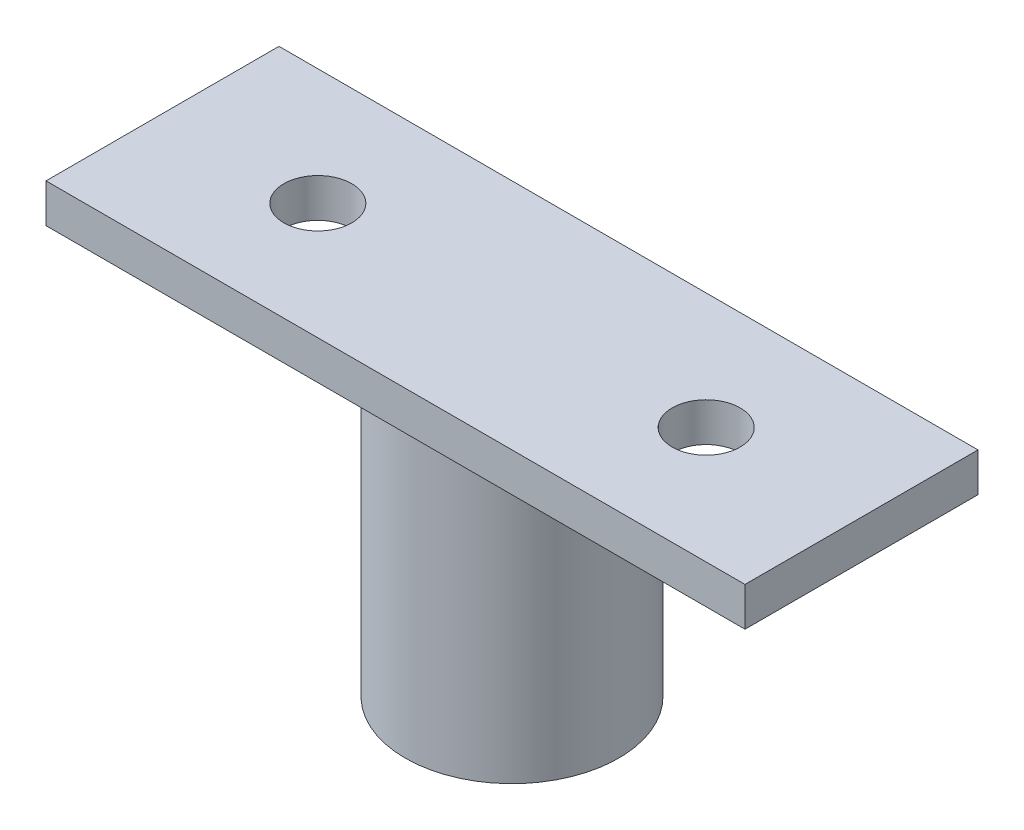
from build123d import *

# Parameters (mm, degrees)
SKETCH1_R           = 5.5
SKETCH1_R_2         = 4
BOSS_EXTRUDE1_DEPTH = 15
SKETCH2_W           = 36
SKETCH2_H           = 12
BOSS_EXTRUDE2_DEPTH = 2
SKETCH3_R           = 1.75
CUT_EXTRUDE1_DEPTH  = 2


with BuildPart() as part:
    # Sketch1 → Boss-Extrude1 (new body)
    with BuildSketch(Plane(origin=(0, 0, 0), x_dir=(1, 0, 0), z_dir=(0, 1, 0))):
        with Locations(Location((0, 0, 0), (0, 0, 270))):
            Circle(SKETCH1_R)
        with Locations(Location((0, 0, 0), (0, 0, 270))):
            Circle(SKETCH1_R_2, mode=Mode.SUBTRACT)
    extrude(amount=BOSS_EXTRUDE1_DEPTH)

    # Sketch2 → Boss-Extrude2 (add)
    with BuildSketch(Plane(origin=(0, 15, 0), x_dir=(1, 0, 0), z_dir=(0, 1, 0))):
        Rectangle(SKETCH2_W, SKETCH2_H)
    extrude(amount=BOSS_EXTRUDE2_DEPTH)

    # Sketch3 → Cut-Extrude1 (cut)
    with BuildSketch(Plane(origin=(0, 17, 0), x_dir=(1, 0, 0), z_dir=(0, 1, 0))):
        with Locations(Location((-10, 0, 0), (0, 0, 270))):
            Circle(SKETCH3_R)
        with Locations(Location((10, 0, 0), (0, 0, 270))):
            Circle(SKETCH3_R)
    extrude(amount=-CUT_EXTRUDE1_DEPTH, mode=Mode.SUBTRACT)


solid = part.part
